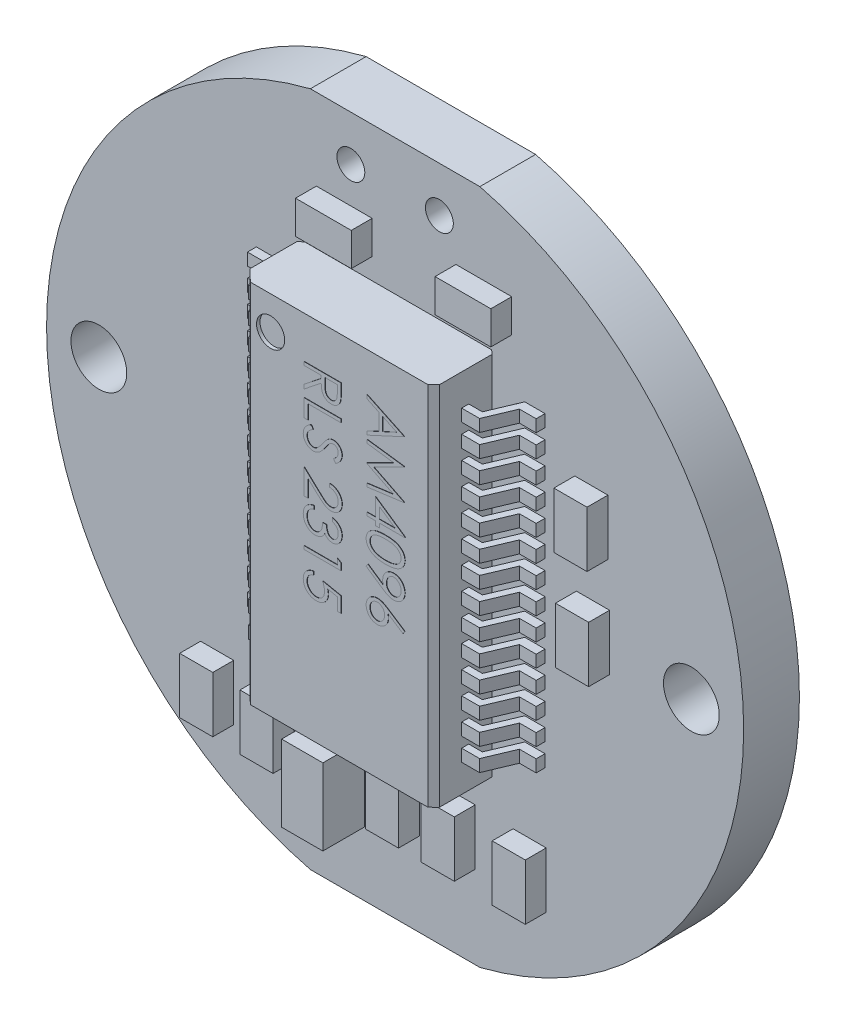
from build123d import *

# Parameters (mm, degrees)
SKETCH1_R           = 0.005
BASE_EXTRUDE_DEPTH  = 1.86
SKETCH5_R           = 0.404245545
CUT_EXTRUDE5_DEPTH  = 0.1
CUT_EXTRUDE9_DEPTH  = 11
BOSS_EXTRUDE1_DEPTH = 0.01
SKETCH7_R           = 0.8
SKETCH7_R_2         = 0.4
EXTRUDE1_DEPTH      = 1.6
SKETCH12_W          = 1.182424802
SKETCH12_H          = 2.190530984
SKETCH12_W_2        = 1.6
SKETCH12_H_2        = 0.95
SKETCH12_W_3        = 0.95
SKETCH12_H_3        = 1.6
EXTRUDE6_DEPTH      = 0.6
SKETCH14_W          = 1.1
SKETCH14_H          = 2.5
SKETCH14_R          = 0.8
BOSS_EXTRUDE2_DEPTH = 0.05
SKETCH18_W          = 1.182424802
SKETCH18_H          = 2.190530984
BOSS_EXTRUDE4_DEPTH = 0.6
BOSS_EXTRUDE5_DEPTH = 1.7
CUT_EXTRUDE10_DEPTH = 8
SKETCH21_W          = 0.9
SKETCH21_H          = 1.6
SKETCH21_W_2        = 1.6
SKETCH21_H_2        = 0.9
SKETCH21_W_3        = 1.559915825
SKETCH21_H_3        = 2.331673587
BOSS_EXTRUDE6_DEPTH = 0.6


with BuildPart() as part:
    # Sketch1 → Base-Extrude (new body)
    with BuildSketch(Plane.XY):
        Polygon((7.968512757, 8.897793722), (9.301851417, 8.897793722), (9.301851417, 8.547793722), (7.968512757, 8.547793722), (7.968512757, 8.247793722), (9.301851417, 8.247793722), (9.301851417, 7.897793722), (7.968512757, 7.897793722), (7.968512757, 7.597793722), (9.301851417, 7.597793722), (9.301851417, 7.247793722), (7.968512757, 7.247793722), (7.968512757, 6.947793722), (9.301851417, 6.947793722), (9.301851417, 6.597793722), (7.968512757, 6.597793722), (7.968512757, 6.297793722), (9.301851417, 6.297793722), (9.301851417, 5.947793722), (7.968512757, 5.947793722), (7.968512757, 5.647793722), (9.301851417, 5.647793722), (9.301851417, 5.297793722), (7.968512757, 5.297793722), (7.968512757, 4.997793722), (9.301851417, 4.997793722), (9.301851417, 4.647793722), (7.968512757, 4.647793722), (7.968512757, 4.347793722), (9.301851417, 4.347793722), (9.301851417, 3.997793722), (7.968512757, 3.997793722), (7.968512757, 3.697793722), (9.301851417, 3.697793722), (9.301851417, 3.347793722), (7.968512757, 3.347793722), (7.968512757, 3.047793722), (9.301851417, 3.047793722), (9.301851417, 2.697793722), (7.968512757, 2.697793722), (7.968512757, 2.397793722), (9.301851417, 2.397793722), (9.301851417, 2.047793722), (7.968512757, 2.047793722), (7.968512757, 1.747793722), (9.301851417, 1.747793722), (9.301851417, 1.397793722), (7.968512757, 1.397793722), (7.968512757, 1.097793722), (9.301851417, 1.097793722), (9.301851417, 0.747793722), (7.968512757, 0.747793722), (7.968512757, 0.447793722), (9.301851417, 0.447793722), (9.301851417, 0.097793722), (7.968512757, 0.097793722), (7.968512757, -0.702206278), (2.368512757, -0.702206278), (2.368512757, 0.097793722), (1.018512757, 0.097793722), (1.018512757, 0.447793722), (2.368512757, 0.447793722), (2.368512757, 0.747793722), (1.018512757, 0.747793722), (1.018512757, 1.097793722), (2.368512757, 1.097793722), (2.368512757, 1.397793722), (1.018512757, 1.397793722), (1.018512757, 1.747793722), (2.368512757, 1.747793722), (2.368512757, 2.047793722), (1.018512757, 2.047793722), (1.018512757, 2.397793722), (2.368512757, 2.397793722), (2.368512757, 2.697793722), (1.018512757, 2.697793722), (1.018512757, 3.047793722), (2.368512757, 3.047793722), (2.368512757, 3.347793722), (1.018512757, 3.347793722), (1.018512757, 3.697793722), (2.368512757, 3.697793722), (2.368512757, 3.997793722), (1.018512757, 3.997793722), (1.018512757, 4.347793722), (2.368512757, 4.347793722), (2.368512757, 4.647793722), (1.018512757, 4.647793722), (1.018512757, 4.997793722), (2.368512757, 4.997793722), (2.368512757, 5.297793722), (1.018512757, 5.297793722), (1.018512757, 5.647793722), (2.368512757, 5.647793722), (2.368512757, 5.947793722), (1.018512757, 5.947793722), (1.018512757, 6.297793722), (2.368512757, 6.297793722), (2.368512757, 6.597793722), (1.018512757, 6.597793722), (1.018512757, 6.947793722), (2.368512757, 6.947793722), (2.368512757, 7.247793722), (1.018512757, 7.247793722), (1.018512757, 7.597793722), (2.368512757, 7.597793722), (2.368512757, 7.897793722), (1.018512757, 7.897793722), (1.018512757, 8.247793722), (2.368512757, 8.247793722), (2.368512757, 8.547793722), (1.018512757, 8.547793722), (1.018512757, 8.897793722), (2.368512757, 8.897793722), (2.368512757, 9.797793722), (7.968512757, 9.797793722), align=None)
        with Locations((5.168512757, 4.547793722)):
            Circle(SKETCH1_R, mode=Mode.SUBTRACT)
    extrude(amount=BASE_EXTRUDE_DEPTH)

    # Sketch5 → Cut-Extrude5 (cut)
    with BuildSketch(Plane.XY.offset(1.86)):
        with Locations((3.288537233, 8.84582504)):
            Circle(SKETCH5_R)
    extrude(amount=-CUT_EXTRUDE5_DEPTH, mode=Mode.SUBTRACT)

    # Sketch15 → Cut-Extrude9 (cut)
    with BuildSketch(Plane(origin=(0, 9.797793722, 0), x_dir=(1, 0, 0), z_dir=(0, 1, 0))):
        Polygon((1.018512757, -0.2554117), (1.515038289, -0.2554117), (1.85430492, -1.060183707), (2.368512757, -1.060183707), (2.368512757, -1.533579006), (2.706416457, -1.86), (2.651187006, -2.385690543), (0.552467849, -2.385690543), (0.552467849, -0.2554117), align=None)
        Polygon((1.617607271, 0), (1.978441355, -0.855932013), (2.368512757, -0.855932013), (2.368512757, -0.187465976), (2.485498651, -0.081833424), (7.851526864, -0.081833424), (7.968512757, -0.187465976), (7.968512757, -0.855932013), (8.35858416, -0.855932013), (8.719418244, 0), align=None)
        Polygon((9.784557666, -2.385690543), (7.747123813, -2.38958058), (7.802761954, -1.86), (7.968512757, -1.696789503), (7.968512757, -1.060183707), (8.482720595, -1.060183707), (8.821987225, -0.2554117), (9.784557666, -0.2554117), align=None)
    extrude(amount=-CUT_EXTRUDE9_DEPTH, mode=Mode.SUBTRACT)

    # Sketch6 → Boss-Extrude1 (add)
    # profile 1 of 13: a face of its own
    with BuildSketch(Plane.XY.offset(1.86)):
        Polygon((7.124163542, 8.168306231), (6.065830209, 7.679844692), (6.065830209, 7.783091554), (6.40503961, 7.939551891), (6.40503961, 8.419321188), (6.065830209, 8.580233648), (6.065830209, 8.683904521), (7.124163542, 8.181874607), align=None)
        Polygon((6.917881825, 8.176150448), (6.513586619, 8.36780376), (6.513586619, 7.989585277), align=None, mode=Mode.SUBTRACT)
    # profile 2 of 13: a face of its own
    with BuildSketch(Plane.XY.offset(1.86)):
        Polygon((6.065830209, 7.571297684), (7.124163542, 7.431585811), (7.124163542, 7.418017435), (6.255787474, 6.981073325), (7.124163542, 6.545189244), (7.124163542, 6.531408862), (6.065830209, 6.390848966), (6.065830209, 6.48625161), (6.827355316, 6.587590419), (6.065830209, 6.969625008), (6.065830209, 6.991037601), (6.829051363, 7.374556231), (6.065830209, 7.475683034), align=None)
    # profile 3 of 13: a face of its own
    with BuildSketch(Plane.XY.offset(1.86)):
        Polygon((7.151300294, 5.691017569), (7.151300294, 5.671725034), (6.418607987, 5.671725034), (6.418607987, 5.54960965), (6.310060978, 5.54960965), (6.310060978, 5.671725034), (6.065830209, 5.671725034), (6.065830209, 5.766703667), (6.310060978, 5.766703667), (6.310060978, 6.268733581), align=None)
        Polygon((6.418607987, 5.766703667), (6.878236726, 5.766703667), (6.418607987, 6.08216841), align=None, mode=Mode.SUBTRACT)
    # profile 4 of 13: a face of its own
    with BuildSketch(Plane.XY.offset(1.86)):
        with BuildLine():
            add(Edge.make_bspline(
                [(6.594572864, 5.454631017), (6.611535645, 5.454531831), (6.644486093, 5.45433916), (6.692499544, 5.452195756), (6.737542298, 5.448635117), (6.77961651, 5.443755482), (6.818733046, 5.437817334), (6.854787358, 5.429890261), (6.887946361, 5.420875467), (6.918318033, 5.410427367), (6.946312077, 5.398638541), (6.97244432, 5.385806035), (6.996681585, 5.37142758), (7.019387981, 5.35630038), (7.040310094, 5.339871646), (7.059408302, 5.322314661), (7.076694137, 5.303455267), (7.09237333, 5.283666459), (7.106031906, 5.262823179), (7.118339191, 5.241567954), (7.128440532, 5.219525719), (7.136740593, 5.196897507), (7.143391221, 5.173749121), (7.147996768, 5.149984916), (7.150883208, 5.12559915), (7.151159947, 5.109140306), (7.151300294, 5.10079321)],
                knots=[0, 0, 0, 0, 1.646377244, 3.198111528, 4.663803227, 6.031090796, 7.308794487, 8.502186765, 9.612154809, 10.642545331, 11.617106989, 12.558866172, 13.465886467, 14.35053239, 15.20542558, 16.045215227, 16.865619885, 17.686225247, 18.492864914, 19.282407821, 20.068097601, 20.842842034, 21.620163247, 22.403093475, 23.190129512, 24, 24, 24, 24], degree=3))
            add(Edge.make_bspline(
                [(7.151300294, 5.10079321), (7.151152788, 5.092376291), (7.150859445, 5.075637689), (7.148040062, 5.050890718), (7.14336189, 5.026715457), (7.136733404, 5.003214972), (7.12850995, 4.980196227), (7.118202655, 4.957839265), (7.106204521, 4.936005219), (7.092106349, 4.915041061), (7.076387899, 4.894716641), (7.058619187, 4.875531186), (7.038979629, 4.857482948), (7.017679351, 4.840345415), (6.994309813, 4.824604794), (6.969277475, 4.809614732), (6.942144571, 4.796197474), (6.913363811, 4.783275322), (6.882138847, 4.7721214), (6.848645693, 4.762062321), (6.812488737, 4.753934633), (6.773857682, 4.747164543), (6.732610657, 4.741919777), (6.688836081, 4.738099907), (6.642505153, 4.736082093), (6.610828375, 4.735702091), (6.594572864, 4.735507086)],
                knots=[0, 0, 0, 0, 0.810914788, 1.612654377, 2.396697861, 3.181598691, 3.963628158, 4.749916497, 5.551656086, 6.361998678, 7.18212741, 8.025565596, 8.878627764, 9.750805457, 10.657531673, 11.591944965, 12.560506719, 13.57287815, 14.630710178, 15.753379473, 16.941251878, 18.199788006, 19.531962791, 20.947069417, 22.433333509, 24, 24, 24, 24], degree=3))
            add(Edge.make_bspline(
                [(6.594572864, 4.735507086), (6.578388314, 4.735704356), (6.546853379, 4.736088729), (6.500730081, 4.73807464), (6.457190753, 4.742004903), (6.416114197, 4.746866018), (6.377744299, 4.75379061), (6.341716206, 4.76166265), (6.308340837, 4.771446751), (6.277280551, 4.782448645), (6.248640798, 4.795090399), (6.221742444, 4.808626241), (6.196730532, 4.823524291), (6.173361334, 4.839358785), (6.151876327, 4.856350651), (6.132222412, 4.874475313), (6.114412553, 4.893746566), (6.098479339, 4.914116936), (6.08454528, 4.93541089), (6.072090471, 4.957172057), (6.061984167, 4.97983477), (6.053451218, 5.002895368), (6.046807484, 5.026571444), (6.042258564, 5.050839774), (6.039059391, 5.07562088), (6.038815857, 5.092373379), (6.038693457, 5.10079321)],
                knots=[0, 0, 0, 0, 1.56130642, 3.042141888, 4.451772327, 5.777565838, 7.030558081, 8.211376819, 9.333164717, 10.383253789, 11.387583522, 12.350962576, 13.286244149, 14.193812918, 15.072134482, 15.925989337, 16.770211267, 17.600669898, 18.417446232, 19.22325363, 20.01647746, 20.807971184, 21.593601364, 22.38506573, 23.188331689, 24, 24, 24, 24], degree=3))
            add(Edge.make_bspline(
                [(6.038693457, 5.10079321), (6.038835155, 5.109139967), (6.039114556, 5.125598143), (6.041981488, 5.149988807), (6.046656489, 5.173715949), (6.053005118, 5.196827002), (6.061073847, 5.219369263), (6.071336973, 5.241121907), (6.083240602, 5.262372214), (6.096783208, 5.283023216), (6.112302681, 5.302681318), (6.129466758, 5.32145915), (6.148705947, 5.338882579), (6.169712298, 5.355105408), (6.19230757, 5.370499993), (6.216714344, 5.384737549), (6.24309143, 5.397545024), (6.27124001, 5.409598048), (6.301834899, 5.420222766), (6.335170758, 5.429536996), (6.371431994, 5.43730171), (6.410510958, 5.443546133), (6.452436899, 5.448694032), (6.497283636, 5.452178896), (6.545012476, 5.454340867), (6.57775127, 5.454532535), (6.594572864, 5.454631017)],
                knots=[0, 0, 0, 0, 0.810940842, 1.599017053, 2.38298203, 3.159479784, 3.926441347, 4.70693857, 5.494146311, 6.292334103, 7.104379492, 7.925868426, 8.762126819, 9.623561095, 10.503686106, 11.41783325, 12.366995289, 13.351843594, 14.392337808, 15.512229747, 16.713911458, 17.994391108, 19.357476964, 20.818259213, 22.365182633, 24, 24, 24, 24], degree=3))
        make_face()
        with BuildLine():
            add(Edge.make_bspline(
                [(6.594996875, 5.359652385), (6.580860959, 5.359616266), (6.553425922, 5.359546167), (6.513559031, 5.357714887), (6.476375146, 5.355220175), (6.441827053, 5.352002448), (6.41003169, 5.34722394), (6.380770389, 5.341869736), (6.354197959, 5.335354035), (6.330132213, 5.327644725), (6.308164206, 5.318864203), (6.287723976, 5.30927574), (6.268563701, 5.298980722), (6.250877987, 5.287438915), (6.234490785, 5.274912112), (6.219449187, 5.261379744), (6.205818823, 5.24686561), (6.189645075, 5.22677329), (6.172733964, 5.200378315), (6.158189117, 5.166951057), (6.148989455, 5.132588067), (6.147822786, 5.109257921), (6.147240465, 5.097613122)],
                knots=[0, 0, 0, 0, 1.459116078, 2.831857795, 4.118796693, 5.306371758, 6.412361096, 7.436813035, 8.376339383, 9.234574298, 10.043323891, 10.816788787, 11.564361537, 12.286735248, 12.994408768, 13.691741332, 14.372975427, 15.047457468, 16.352811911, 17.594285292, 18.799233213, 20, 20, 20, 20], degree=3))
            add(Edge.make_bspline(
                [(6.147240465, 5.097613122), (6.147723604, 5.08589354), (6.148688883, 5.062478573), (6.158001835, 5.028269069), (6.172053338, 4.995058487), (6.188668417, 4.969031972), (6.204491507, 4.949231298), (6.217982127, 4.935044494), (6.23308783, 4.922023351), (6.24938595, 4.909673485), (6.267187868, 4.898346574), (6.28640798, 4.88804653), (6.30709966, 4.878647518), (6.321544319, 4.87329264), (6.328929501, 4.870554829)],
                knots=[0, 0, 0, 0, 1.353760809, 2.704726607, 4.075137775, 5.516104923, 6.260822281, 7.007110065, 7.778089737, 8.566572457, 9.372053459, 10.217411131, 11.088608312, 12, 12, 12, 12], degree=3))
            add(Edge.make_bspline(
                [(6.328929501, 4.870554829), (6.338372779, 4.867364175), (6.357546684, 4.86088578), (6.387289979, 4.852536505), (6.418496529, 4.845961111), (6.450979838, 4.840045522), (6.484979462, 4.836007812), (6.520390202, 4.832757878), (6.557238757, 4.830843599), (6.582274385, 4.830606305), (6.594996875, 4.830485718)],
                knots=[0, 0, 0, 0, 0.884706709, 1.796334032, 2.740027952, 3.714592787, 4.726048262, 5.777819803, 6.87074269, 8, 8, 8, 8], degree=3))
            add(Edge.make_bspline(
                [(6.594996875, 4.830485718), (6.607719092, 4.830618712), (6.632609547, 4.83087891), (6.669024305, 4.832588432), (6.703670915, 4.835335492), (6.736580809, 4.839053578), (6.76769541, 4.844157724), (6.797059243, 4.850287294), (6.824664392, 4.857473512), (6.850582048, 4.865716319), (6.874719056, 4.875005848), (6.897127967, 4.885267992), (6.91792758, 4.89621909), (6.937058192, 4.908115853), (6.954606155, 4.920814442), (6.970219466, 4.93465068), (6.984382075, 4.949075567), (7.000548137, 4.969279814), (7.017031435, 4.995730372), (7.032200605, 5.028643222), (7.040911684, 5.062894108), (7.042139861, 5.086048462), (7.042753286, 5.097613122)],
                knots=[0, 0, 0, 0, 1.313668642, 2.570134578, 3.763346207, 4.902004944, 5.98888779, 7.017888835, 7.998425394, 8.933058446, 9.82474457, 10.667209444, 11.476765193, 12.250262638, 12.991704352, 13.7104269, 14.401925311, 15.076585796, 16.378385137, 17.609787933, 18.806186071, 20, 20, 20, 20], degree=3))
            add(Edge.make_bspline(
                [(7.042753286, 5.097613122), (7.042139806, 5.109318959), (7.04091173, 5.132751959), (7.032223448, 5.167351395), (7.017172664, 5.200498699), (7.000441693, 5.226737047), (6.984668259, 5.246915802), (6.970951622, 5.26116482), (6.95586452, 5.274486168), (6.939546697, 5.287023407), (6.921852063, 5.298554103), (6.902694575, 5.308853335), (6.882252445, 5.318436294), (6.860289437, 5.327235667), (6.83618741, 5.334873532), (6.809749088, 5.341700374), (6.780460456, 5.34705133), (6.748576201, 5.351720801), (6.713985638, 5.355281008), (6.676716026, 5.357708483), (6.636780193, 5.359549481), (6.609203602, 5.359617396), (6.594996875, 5.359652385)],
                knots=[0, 0, 0, 0, 1.207964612, 2.418129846, 3.655795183, 4.951004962, 5.620895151, 6.296795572, 6.989224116, 7.696855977, 8.419187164, 9.166715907, 9.940135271, 10.748837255, 11.607021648, 12.548275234, 13.5654991, 14.678641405, 15.874140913, 17.15372626, 18.533675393, 20, 20, 20, 20], degree=3))
        make_face(mode=Mode.SUBTRACT)
    # profile 5 of 13: a face of its own
    with BuildSketch(Plane.XY.offset(1.86)):
        with BuildLine():
            Line((6.038693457, 4.40986606), (6.09148292, 4.485764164))
            Line((6.09148292, 4.485764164), (6.521642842, 4.191500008))
            add(Edge.make_bspline(
                [(6.521642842, 4.191500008), (6.519346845, 4.210275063), (6.514825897, 4.247244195), (6.513995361, 4.284478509), (6.513586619, 4.302803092)],
                knots=[0, 0, 0, 0, 1.015715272, 2, 2, 2, 2], degree=3))
            add(Edge.make_bspline(
                [(6.513586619, 4.302803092), (6.513872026, 4.313912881), (6.514432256, 4.335720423), (6.518847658, 4.367786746), (6.525725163, 4.398644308), (6.535749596, 4.428175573), (6.548561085, 4.456354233), (6.56416715, 4.483278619), (6.582625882, 4.508913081), (6.603738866, 4.532955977), (6.6269257, 4.554821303), (6.6514654, 4.574301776), (6.677644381, 4.59049157), (6.704928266, 4.603940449), (6.733709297, 4.614139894), (6.763659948, 4.621567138), (6.794990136, 4.62613985), (6.816315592, 4.626683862), (6.82714331, 4.626960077)],
                knots=[0, 0, 0, 0, 1.060702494, 2.082066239, 3.085748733, 4.076089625, 5.054723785, 6.037561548, 7.043420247, 8.066922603, 9.088643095, 10.08373341, 11.053858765, 12.022809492, 12.983497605, 13.964038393, 14.966267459, 16, 16, 16, 16], degree=3))
            add(Edge.make_bspline(
                [(6.82714331, 4.626960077), (6.841950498, 4.626435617), (6.871014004, 4.625406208), (6.9134785, 4.617121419), (6.953630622, 4.60349603), (6.9913648, 4.584497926), (7.026138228, 4.560569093), (7.057467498, 4.531810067), (7.084907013, 4.498395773), (7.10849396, 4.461087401), (7.127463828, 4.420763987), (7.141445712, 4.378530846), (7.149670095, 4.334711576), (7.150754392, 4.305027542), (7.151300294, 4.29008274)],
                knots=[0, 0, 0, 0, 1.022988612, 2.007919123, 2.978103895, 3.94594894, 4.918897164, 5.887013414, 6.875921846, 7.89917871, 8.930658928, 9.948724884, 10.967259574, 12, 12, 12, 12], degree=3))
            add(Edge.make_bspline(
                [(7.151300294, 4.29008274), (7.150748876, 4.275420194), (7.149659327, 4.246448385), (7.141609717, 4.2037883), (7.128187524, 4.16289293), (7.109553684, 4.124084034), (7.086045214, 4.088336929), (7.058263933, 4.056068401), (7.025896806, 4.028142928), (6.989829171, 4.004608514), (6.951073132, 3.985719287), (6.910619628, 3.97209015), (6.868758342, 3.963700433), (6.840396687, 3.962643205), (6.82608328, 3.96210965)],
                knots=[0, 0, 0, 0, 1.026337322, 2.02794581, 3.027878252, 4.032696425, 5.033228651, 6.015458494, 7.004668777, 8.016190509, 9.023163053, 10.0152653, 10.998354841, 12, 12, 12, 12], degree=3))
            add(Edge.make_bspline(
                [(6.82608328, 3.96210965), (6.814971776, 3.962461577), (6.792434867, 3.963175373), (6.758226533, 3.968303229), (6.723274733, 3.97660839), (6.693652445, 3.986242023), (6.669435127, 3.99610689), (6.650000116, 4.004594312), (6.629718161, 4.014473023), (6.608738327, 4.026207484), (6.586508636, 4.038475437), (6.563514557, 4.052424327), (6.539627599, 4.067629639), (6.523527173, 4.078464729), (6.515282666, 4.084013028)],
                knots=[0, 0, 0, 0, 1.179688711, 2.392703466, 3.66501481, 4.991562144, 5.695278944, 6.441221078, 7.243328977, 8.089575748, 8.993388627, 9.939305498, 10.944784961, 12, 12, 12, 12], degree=3))
            Line((6.515282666, 4.084013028), (6.038693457, 4.40986606))
        make_face()
        with BuildLine():
            add(Edge.make_bspline(
                [(6.622133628, 4.285206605), (6.622363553, 4.276790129), (6.62281114, 4.260406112), (6.625535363, 4.236403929), (6.630365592, 4.213748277), (6.637296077, 4.192378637), (6.645658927, 4.172080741), (6.65630636, 4.153176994), (6.669011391, 4.135651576), (6.6832868, 4.119387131), (6.699146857, 4.104944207), (6.715746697, 4.092080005), (6.733159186, 4.081145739), (6.751602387, 4.072508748), (6.770627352, 4.065407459), (6.790540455, 4.060503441), (6.811237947, 4.05778675), (6.825298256, 4.057323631), (6.832443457, 4.057088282)],
                knots=[0, 0, 0, 0, 1.163407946, 2.26475976, 3.333800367, 4.359385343, 5.366239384, 6.363380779, 7.350133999, 8.353570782, 9.349036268, 10.310270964, 11.253520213, 12.184142, 13.120487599, 14.056272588, 15.012232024, 16, 16, 16, 16], degree=3))
            add(Edge.make_bspline(
                [(6.832443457, 4.057088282), (6.839591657, 4.057290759), (6.853678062, 4.057689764), (6.874405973, 4.060891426), (6.894271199, 4.066522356), (6.913377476, 4.074082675), (6.931586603, 4.084023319), (6.949017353, 4.095996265), (6.965885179, 4.109941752), (6.981321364, 4.12630773), (6.995734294, 4.143915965), (7.008228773, 4.162848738), (7.01889419, 4.182636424), (7.02761993, 4.203294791), (7.034442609, 4.22486684), (7.039345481, 4.247353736), (7.042058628, 4.270865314), (7.042518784, 4.286825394), (7.042753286, 4.294958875)],
                knots=[0, 0, 0, 0, 0.972051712, 1.915547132, 2.843788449, 3.775556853, 4.704594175, 5.659091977, 6.648619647, 7.675179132, 8.714041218, 9.74046568, 10.755438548, 11.767722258, 12.786148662, 13.828784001, 14.893517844, 16, 16, 16, 16], degree=3))
            add(Edge.make_bspline(
                [(7.042753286, 4.294958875), (7.042518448, 4.30302164), (7.042057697, 4.318840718), (7.039350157, 4.342142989), (7.034411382, 4.364478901), (7.027616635, 4.385984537), (7.018941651, 4.406599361), (7.008228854, 4.426229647), (6.995667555, 4.444965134), (6.981339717, 4.462568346), (6.965811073, 4.478899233), (6.949091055, 4.493090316), (6.931577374, 4.505035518), (6.913379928, 4.514989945), (6.894270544, 4.522546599), (6.87440615, 4.528178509), (6.853678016, 4.531379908), (6.839591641, 4.531778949), (6.832443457, 4.531981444)],
                knots=[0, 0, 0, 0, 1.099545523, 2.15729926, 3.193054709, 4.213957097, 5.228701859, 6.237665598, 7.258567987, 8.299955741, 9.329010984, 10.327149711, 11.283968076, 12.215264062, 13.149297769, 14.079795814, 15.025585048, 16, 16, 16, 16], degree=3))
            add(Edge.make_bspline(
                [(6.832443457, 4.531981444), (6.825292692, 4.531798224), (6.811190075, 4.53143688), (6.790468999, 4.527951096), (6.77060614, 4.522121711), (6.751408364, 4.514314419), (6.73306235, 4.504032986), (6.715655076, 4.491416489), (6.698989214, 4.476628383), (6.6833237, 4.459866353), (6.668944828, 4.441521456), (6.656386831, 4.421928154), (6.645781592, 4.401423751), (6.637272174, 4.379936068), (6.630434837, 4.357624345), (6.625544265, 4.334288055), (6.62283727, 4.310004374), (6.622370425, 4.293551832), (6.622133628, 4.285206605)],
                knots=[0, 0, 0, 0, 0.952633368, 1.87876736, 2.791047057, 3.707742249, 4.635551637, 5.587206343, 6.568248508, 7.601284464, 8.641511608, 9.671105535, 10.699146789, 11.713763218, 12.747829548, 13.806491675, 14.887386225, 16, 16, 16, 16], degree=3))
        make_face(mode=Mode.SUBTRACT)
    # profile 6 of 13: a face of its own
    with BuildSketch(Plane.XY.offset(1.86)):
        with BuildLine():
            Line((7.151300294, 3.33796435), (7.093846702, 3.264822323))
            Line((7.093846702, 3.264822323), (6.66623085, 3.544458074))
            add(Edge.make_bspline(
                [(6.66623085, 3.544458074), (6.669198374, 3.525840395), (6.674986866, 3.489524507), (6.675941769, 3.452765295), (6.676407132, 3.434851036)],
                knots=[0, 0, 0, 0, 1.025318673, 2, 2, 2, 2], degree=3))
            add(Edge.make_bspline(
                [(6.676407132, 3.434851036), (6.676118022, 3.424094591), (6.675548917, 3.402920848), (6.671169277, 3.371834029), (6.664267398, 3.341962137), (6.654206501, 3.313428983), (6.641354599, 3.286132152), (6.625951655, 3.259914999), (6.607202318, 3.235270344), (6.586257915, 3.211880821), (6.56306016, 3.190645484), (6.538445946, 3.171844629), (6.512440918, 3.156052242), (6.485058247, 3.143239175), (6.456340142, 3.133289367), (6.426323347, 3.12603596), (6.394987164, 3.121748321), (6.373675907, 3.121166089), (6.362850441, 3.120870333)],
                knots=[0, 0, 0, 0, 1.04369286, 2.054478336, 3.041073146, 4.015093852, 4.984733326, 5.965804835, 6.960378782, 7.985147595, 9.009457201, 10.008161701, 10.986880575, 11.956520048, 12.937015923, 13.931873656, 14.949455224, 16, 16, 16, 16], degree=3))
            add(Edge.make_bspline(
                [(6.362850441, 3.120870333), (6.348048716, 3.121422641), (6.318939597, 3.12250881), (6.276365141, 3.130415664), (6.236130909, 3.144061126), (6.198078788, 3.162317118), (6.163315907, 3.186002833), (6.131899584, 3.214071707), (6.104515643, 3.246789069), (6.081024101, 3.283380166), (6.062360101, 3.322983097), (6.048561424, 3.364508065), (6.040316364, 3.407600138), (6.039236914, 3.436865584), (6.038693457, 3.4515995)],
                knots=[0, 0, 0, 0, 1.031881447, 2.029301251, 3.006342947, 3.987068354, 4.962916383, 5.929513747, 6.915671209, 7.928552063, 8.953527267, 9.960179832, 10.973036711, 12, 12, 12, 12], degree=3))
            add(Edge.make_bspline(
                [(6.038693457, 3.4515995), (6.039155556, 3.465840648), (6.040070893, 3.494049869), (6.048224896, 3.535546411), (6.061441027, 3.575419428), (6.079648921, 3.613388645), (6.102646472, 3.648563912), (6.130336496, 3.680023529), (6.162107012, 3.707658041), (6.198055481, 3.730534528), (6.236435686, 3.749178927), (6.276819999, 3.762329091), (6.318395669, 3.770833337), (6.346696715, 3.771710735), (6.360942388, 3.772152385)],
                knots=[0, 0, 0, 0, 1.011913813, 2.004424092, 2.994488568, 3.992479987, 4.990471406, 5.973328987, 6.963763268, 7.974390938, 8.994854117, 9.989689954, 10.988086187, 12, 12, 12, 12], degree=3))
            add(Edge.make_bspline(
                [(6.360942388, 3.772152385), (6.371837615, 3.77176883), (6.394073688, 3.770986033), (6.427848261, 3.766314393), (6.462271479, 3.757746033), (6.49145295, 3.748473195), (6.515620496, 3.739271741), (6.534704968, 3.73073994), (6.554858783, 3.721200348), (6.575700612, 3.710018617), (6.59782595, 3.698165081), (6.620415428, 3.684318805), (6.644294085, 3.669870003), (6.660192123, 3.659285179), (6.668350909, 3.653853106)],
                knots=[0, 0, 0, 0, 1.17367173, 2.395347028, 3.66355231, 4.98980831, 5.690886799, 6.447442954, 7.240630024, 8.091733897, 8.994365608, 9.943299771, 10.944512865, 12, 12, 12, 12], degree=3))
            Line((6.668350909, 3.653853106), (7.151300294, 3.33796435))
        make_face()
        with BuildLine():
            add(Edge.make_bspline(
                [(6.567860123, 3.454779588), (6.567621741, 3.46284149), (6.567154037, 3.478658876), (6.564512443, 3.501835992), (6.559507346, 3.523712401), (6.553033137, 3.544537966), (6.544218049, 3.564095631), (6.533637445, 3.582608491), (6.521057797, 3.599892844), (6.506619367, 3.615645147), (6.491042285, 3.630109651), (6.474257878, 3.642551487), (6.456778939, 3.653295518), (6.438441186, 3.662028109), (6.419256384, 3.668828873), (6.399311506, 3.67374803), (6.378473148, 3.676485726), (6.364342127, 3.67694118), (6.357126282, 3.677173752)],
                knots=[0, 0, 0, 0, 1.129474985, 2.216020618, 3.260639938, 4.268601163, 5.26556745, 6.258792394, 7.250684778, 8.252748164, 9.247500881, 10.223461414, 11.174097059, 12.117127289, 13.062595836, 14.020469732, 14.98917545, 16, 16, 16, 16], degree=3))
            add(Edge.make_bspline(
                [(6.357126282, 3.677173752), (6.349975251, 3.676983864), (6.335953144, 3.676611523), (6.315284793, 3.673246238), (6.295413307, 3.668069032), (6.276324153, 3.660490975), (6.258121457, 3.650985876), (6.240675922, 3.639288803), (6.223975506, 3.625597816), (6.208441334, 3.609682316), (6.194193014, 3.592518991), (6.181506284, 3.574367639), (6.170852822, 3.555285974), (6.162430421, 3.535165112), (6.155532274, 3.514286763), (6.15067463, 3.492491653), (6.147929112, 3.46976063), (6.147473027, 3.454362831), (6.147240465, 3.446511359)],
                knots=[0, 0, 0, 0, 0.989642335, 1.94054129, 2.892446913, 3.828371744, 4.778262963, 5.730973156, 6.732161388, 7.763274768, 8.805796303, 9.818398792, 10.825975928, 11.825728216, 12.834635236, 13.867465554, 14.912602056, 16, 16, 16, 16], degree=3))
            add(Edge.make_bspline(
                [(6.147240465, 3.446511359), (6.147473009, 3.438659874), (6.147929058, 3.42326205), (6.150674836, 3.40053121), (6.155531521, 3.378735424), (6.162433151, 3.357859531), (6.170842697, 3.337729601), (6.18157304, 3.318631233), (6.194115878, 3.300306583), (6.208465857, 3.283154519), (6.223887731, 3.267172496), (6.240827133, 3.253802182), (6.257982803, 3.241735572), (6.276396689, 3.232595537), (6.295401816, 3.224933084), (6.315287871, 3.219782), (6.335952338, 3.21640975), (6.349974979, 3.216038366), (6.357126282, 3.215848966)],
                knots=[0, 0, 0, 0, 1.087205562, 2.132157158, 3.164804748, 4.173533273, 5.173108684, 6.180507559, 7.20098426, 8.243321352, 9.274252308, 10.269075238, 11.227079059, 12.172305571, 13.108064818, 14.05980203, 15.010532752, 16, 16, 16, 16], degree=3))
            add(Edge.make_bspline(
                [(6.357126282, 3.215848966), (6.364352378, 3.216013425), (6.378534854, 3.216336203), (6.399292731, 3.220057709), (6.419418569, 3.225084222), (6.438458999, 3.233207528), (6.456940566, 3.242883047), (6.474335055, 3.255209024), (6.491135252, 3.269341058), (6.506722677, 3.285707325), (6.520980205, 3.303512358), (6.533564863, 3.322446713), (6.544186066, 3.34225492), (6.553047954, 3.362917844), (6.559443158, 3.38467199), (6.56447878, 3.407166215), (6.567158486, 3.430688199), (6.567623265, 3.446646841), (6.567860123, 3.454779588)],
                knots=[0, 0, 0, 0, 0.978265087, 1.920016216, 2.851775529, 3.783928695, 4.718195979, 5.674835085, 6.667117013, 7.690134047, 8.732874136, 9.755756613, 10.767227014, 11.776017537, 12.797239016, 13.836276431, 14.897336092, 16, 16, 16, 16], degree=3))
        make_face(mode=Mode.SUBTRACT)
    # profile 7 of 13: a face of its own
    with BuildSketch(Plane.XY.offset(1.86)):
        with BuildLine():
            Line((5.319569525, 8.602494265), (5.319569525, 8.390700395))
            add(Edge.make_bspline(
                [(5.319569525, 8.390700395), (5.319522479, 8.376566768), (5.319432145, 8.349428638), (5.31892845, 8.310550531), (5.317484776, 8.275224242), (5.316242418, 8.243468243), (5.313976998, 8.215283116), (5.311811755, 8.190582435), (5.308977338, 8.169479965), (5.306344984, 8.156705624), (5.305153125, 8.150921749)],
                knots=[0, 0, 0, 0, 1.410062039, 2.707475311, 3.878576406, 4.937260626, 5.877586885, 6.699081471, 7.410979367, 8, 8, 8, 8], degree=3))
            add(Edge.make_bspline(
                [(5.305153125, 8.150921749), (5.303240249, 8.143178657), (5.299455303, 8.127857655), (5.291451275, 8.105800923), (5.2822041, 8.084773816), (5.271258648, 8.064855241), (5.258805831, 8.046043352), (5.244772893, 8.028366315), (5.229088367, 8.011925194), (5.212152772, 7.996593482), (5.193818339, 7.98269578), (5.174352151, 7.970669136), (5.153875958, 7.960370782), (5.132318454, 7.952149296), (5.109861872, 7.945535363), (5.086310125, 7.940870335), (5.061768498, 7.93807307), (5.045029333, 7.937788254), (5.03654168, 7.937643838)],
                knots=[0, 0, 0, 0, 1.02737288, 2.032829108, 3.019628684, 3.985738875, 4.958353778, 5.924249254, 6.890702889, 7.883913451, 8.865824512, 9.85161466, 10.829249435, 11.81541824, 12.821369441, 13.843154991, 14.906364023, 16, 16, 16, 16], degree=3))
            add(Edge.make_bspline(
                [(5.03654168, 7.937643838), (5.022440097, 7.938088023), (4.994924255, 7.938954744), (4.954991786, 7.947036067), (4.917740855, 7.960272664), (4.883223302, 7.978515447), (4.852093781, 8.001736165), (4.824844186, 8.029642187), (4.801830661, 8.062091), (4.786041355, 8.092440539), (4.775881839, 8.11926245), (4.768697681, 8.141408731), (4.763240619, 8.165584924), (4.758280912, 8.191444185), (4.754496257, 8.219186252), (4.751808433, 8.248755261), (4.750080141, 8.280225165), (4.749827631, 8.30179695), (4.74969773, 8.312894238)],
                knots=[0, 0, 0, 0, 1.260402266, 2.459371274, 3.627181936, 4.786749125, 5.93865593, 7.087644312, 8.261344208, 9.485713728, 10.136162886, 10.825977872, 11.566646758, 12.35154167, 13.181268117, 14.0701832, 15.007234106, 16, 16, 16, 16], degree=3))
            Line((4.74969773, 8.312894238), (4.261236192, 7.924075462))
            Line((4.261236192, 7.924075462), (4.261236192, 8.041526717))
            Line((4.261236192, 8.041526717), (4.74969773, 8.430345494))
            Line((4.74969773, 8.430345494), (4.74969773, 8.507515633))
            Line((4.74969773, 8.507515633), (4.261236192, 8.507515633))
            Line((4.261236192, 8.507515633), (4.261236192, 8.602494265))
            Line((4.261236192, 8.602494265), (5.319569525, 8.602494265))
        make_face()
        with BuildLine():
            Line((5.211022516, 8.507515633), (4.858244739, 8.507515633))
            Line((4.858244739, 8.507515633), (4.856760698, 8.313742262))
            add(Edge.make_bspline(
                [(4.856760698, 8.313742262), (4.856756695, 8.304695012), (4.856748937, 8.287158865), (4.857956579, 8.261788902), (4.859330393, 8.23816687), (4.861431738, 8.216383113), (4.864139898, 8.196427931), (4.86752742, 8.178311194), (4.87147427, 8.162003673), (4.877582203, 8.142983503), (4.887264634, 8.121751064), (4.901327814, 8.098647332), (4.919130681, 8.079039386), (4.939164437, 8.062133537), (4.961644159, 8.049111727), (4.985572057, 8.039634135), (5.010741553, 8.033686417), (5.028029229, 8.032979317), (5.036753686, 8.03262247)],
                knots=[0, 0, 0, 0, 1.14660753, 2.222451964, 3.218720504, 4.145691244, 4.995719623, 5.770487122, 6.480909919, 7.121111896, 8.299844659, 9.430703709, 10.534634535, 11.641396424, 12.741395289, 13.810956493, 14.895269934, 16, 16, 16, 16], degree=3))
            add(Edge.make_bspline(
                [(5.036753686, 8.03262247), (5.045267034, 8.032980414), (5.062137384, 8.033689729), (5.086767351, 8.039645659), (5.110179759, 8.049263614), (5.131928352, 8.062750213), (5.151834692, 8.0790467), (5.168631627, 8.098401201), (5.18269808, 8.119839), (5.191621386, 8.139889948), (5.197103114, 8.157799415), (5.200955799, 8.173351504), (5.204077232, 8.190990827), (5.206504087, 8.210675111), (5.208687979, 8.232368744), (5.210103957, 8.256131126), (5.210959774, 8.281934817), (5.211001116, 8.299819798), (5.211022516, 8.309078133)],
                knots=[0, 0, 0, 0, 1.100801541, 2.181386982, 3.260112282, 4.364594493, 5.481957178, 6.577424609, 7.668452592, 8.790448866, 9.403819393, 10.091598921, 10.863153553, 11.720938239, 12.658472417, 13.685008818, 14.801622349, 16, 16, 16, 16], degree=3))
            Line((5.211022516, 8.309078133), (5.211022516, 8.507515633))
        make_face(mode=Mode.SUBTRACT)
    # profile 8 of 13: a face of its own
    with BuildSketch(Plane.XY.offset(1.86)):
        Polygon((5.319569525, 7.706981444), (5.319569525, 7.612002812), (4.3697832, 7.612002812), (4.3697832, 7.20495153), (4.261236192, 7.20495153), (4.261236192, 7.706981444), align=None)
    # profile 9 of 13: a face of its own
    with BuildSketch(Plane.XY.offset(1.86)):
        with BuildLine():
            Line((4.46539785, 7.13710965), (4.519035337, 7.04764317))
            add(Edge.make_bspline(
                [(4.519035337, 7.04764317), (4.505106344, 7.039322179), (4.478418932, 7.023379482), (4.442357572, 6.996784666), (4.411707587, 6.96922781), (4.386647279, 6.940504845), (4.366917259, 6.910791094), (4.352946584, 6.879892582), (4.344233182, 6.847913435), (4.343174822, 6.826149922), (4.342646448, 6.81528473)],
                knots=[0, 0, 0, 0, 1.272034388, 2.437168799, 3.508375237, 4.49857839, 5.41946034, 6.295179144, 7.148887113, 8, 8, 8, 8], degree=3))
            add(Edge.make_bspline(
                [(4.342646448, 6.81528473), (4.342904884, 6.806005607), (4.343417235, 6.787609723), (4.348340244, 6.760527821), (4.355903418, 6.734226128), (4.366735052, 6.709247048), (4.379839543, 6.685934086), (4.39566888, 6.665493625), (4.413387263, 6.647811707), (4.433168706, 6.633387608), (4.454369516, 6.622190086), (4.476325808, 6.614087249), (4.498941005, 6.608930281), (4.514273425, 6.608273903), (4.522003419, 6.607942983)],
                knots=[0, 0, 0, 0, 1.095270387, 2.171376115, 3.241375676, 4.322296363, 5.380636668, 6.392615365, 7.366724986, 8.328592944, 9.273498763, 10.190095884, 11.087518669, 12, 12, 12, 12], degree=3))
            add(Edge.make_bspline(
                [(4.522003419, 6.607942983), (4.530815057, 6.608388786), (4.548727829, 6.60929504), (4.57515582, 6.616954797), (4.601309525, 6.62900445), (4.617487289, 6.640120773), (4.625886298, 6.645892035)],
                knots=[0, 0, 0, 0, 0.938893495, 1.908633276, 2.914225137, 4, 4, 4, 4], degree=3))
            add(Edge.make_bspline(
                [(4.625886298, 6.645892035), (4.631960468, 6.650617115), (4.644749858, 6.660565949), (4.663468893, 6.677906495), (4.683249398, 6.697725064), (4.704011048, 6.720120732), (4.725374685, 6.745538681), (4.747785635, 6.773456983), (4.771176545, 6.804020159), (4.786644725, 6.825559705), (4.794642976, 6.836697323)],
                knots=[0, 0, 0, 0, 0.72226686, 1.520759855, 2.393439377, 3.351307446, 4.386958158, 5.510256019, 6.712608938, 8, 8, 8, 8], degree=3))
            add(Edge.make_bspline(
                [(4.794642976, 6.836697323), (4.802575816, 6.847830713), (4.817742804, 6.869116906), (4.840223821, 6.898908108), (4.860908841, 6.925512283), (4.879509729, 6.949064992), (4.896837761, 6.968956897), (4.911964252, 6.985915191), (4.925696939, 6.999314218), (4.93459842, 7.006770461), (4.938594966, 7.01011813)],
                knots=[0, 0, 0, 0, 1.452255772, 2.776602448, 3.96446981, 5.032613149, 5.964194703, 6.766668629, 7.446264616, 8, 8, 8, 8], degree=3))
            add(Edge.make_bspline(
                [(4.938594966, 7.01011813), (4.944824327, 7.014796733), (4.957075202, 7.023997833), (4.976223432, 7.036143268), (4.995824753, 7.046466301), (5.015931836, 7.05455872), (5.036262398, 7.061373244), (5.057081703, 7.065956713), (5.078296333, 7.068826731), (5.092572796, 7.069120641), (5.099719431, 7.069267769)],
                knots=[0, 0, 0, 0, 1.068054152, 2.10047183, 3.106115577, 4.101338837, 5.06977816, 6.043150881, 7.020423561, 8, 8, 8, 8], degree=3))
            add(Edge.make_bspline(
                [(5.099719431, 7.069267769), (5.110917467, 7.068874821), (5.133074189, 7.068097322), (5.165424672, 7.061468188), (5.196405, 7.051127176), (5.22533277, 7.036171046), (5.252140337, 7.017679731), (5.276418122, 6.995825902), (5.297001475, 6.96987929), (5.314776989, 6.941252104), (5.328811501, 6.910119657), (5.339454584, 6.877555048), (5.345404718, 6.843415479), (5.346268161, 6.820253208), (5.346706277, 6.808500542)],
                knots=[0, 0, 0, 0, 1.005541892, 1.989591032, 2.955705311, 3.932863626, 4.905387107, 5.876519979, 6.856563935, 7.871847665, 8.897921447, 9.918317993, 10.943742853, 12, 12, 12, 12], degree=3))
            add(Edge.make_bspline(
                [(5.346706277, 6.808500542), (5.346284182, 6.796027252), (5.345447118, 6.771291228), (5.337908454, 6.734837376), (5.325731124, 6.699672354), (5.311705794, 6.671366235), (5.297760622, 6.649250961), (5.285053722, 6.632386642), (5.270426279, 6.615296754), (5.253837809, 6.59784394), (5.235136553, 6.58032378), (5.214450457, 6.562476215), (5.191905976, 6.544259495), (5.175811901, 6.532540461), (5.167561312, 6.526532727)],
                knots=[0, 0, 0, 0, 1.286821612, 2.551921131, 3.825787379, 5.12137259, 5.803616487, 6.523126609, 7.299589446, 8.125436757, 9.008162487, 9.944516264, 10.946261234, 12, 12, 12, 12], degree=3))
            Line((5.167561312, 6.526532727), (5.102475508, 6.612395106))
            add(Edge.make_bspline(
                [(5.102475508, 6.612395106), (5.109154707, 6.61757971), (5.122017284, 6.627564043), (5.140030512, 6.642722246), (5.156485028, 6.657009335), (5.170777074, 6.671085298), (5.183689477, 6.684206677), (5.194744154, 6.696942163), (5.204051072, 6.709107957), (5.213978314, 6.724445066), (5.223881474, 6.743762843), (5.23208298, 6.767988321), (5.237188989, 6.793235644), (5.237832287, 6.81038433), (5.238159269, 6.819100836)],
                knots=[0, 0, 0, 0, 1.181667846, 2.275615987, 3.290305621, 4.226321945, 5.078535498, 5.862783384, 6.581873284, 7.217493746, 8.414623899, 9.604724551, 10.782505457, 12, 12, 12, 12], degree=3))
            add(Edge.make_bspline(
                [(5.238159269, 6.819100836), (5.237792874, 6.830033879), (5.237086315, 6.851117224), (5.229369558, 6.881049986), (5.217219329, 6.907990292), (5.200190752, 6.931138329), (5.180015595, 6.950411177), (5.156799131, 6.96435259), (5.131162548, 6.972743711), (5.113279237, 6.973767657), (5.104171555, 6.974289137)],
                knots=[0, 0, 0, 0, 1.14458467, 2.207223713, 3.21896685, 4.227309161, 5.202851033, 6.127160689, 7.046193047, 8, 8, 8, 8], degree=3))
            add(Edge.make_bspline(
                [(5.104171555, 6.974289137), (5.098502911, 6.974164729), (5.087156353, 6.973915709), (5.070348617, 6.970676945), (5.053690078, 6.966084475), (5.037106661, 6.959363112), (5.02020823, 6.950309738), (5.003040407, 6.937999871), (4.985169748, 6.922599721), (4.973558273, 6.910779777), (4.967427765, 6.904539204)],
                knots=[0, 0, 0, 0, 0.858526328, 1.718456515, 2.587092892, 3.476767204, 4.426280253, 5.487868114, 6.673670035, 8, 8, 8, 8], degree=3))
            add(Edge.make_bspline(
                [(4.967427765, 6.904539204), (4.965360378, 6.90222255), (4.960448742, 6.896718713), (4.952407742, 6.886656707), (4.942488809, 6.873369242), (4.930215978, 6.85720329), (4.91597944, 6.837860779), (4.899961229, 6.81533958), (4.88164134, 6.789890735), (4.868833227, 6.771831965), (4.862060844, 6.762283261)],
                knots=[0, 0, 0, 0, 0.420754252, 0.999615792, 1.744751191, 2.668019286, 3.750313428, 4.999500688, 6.413464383, 8, 8, 8, 8], degree=3))
            add(Edge.make_bspline(
                [(4.862060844, 6.762283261), (4.853702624, 6.750797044), (4.837518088, 6.728555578), (4.813201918, 6.696909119), (4.789420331, 6.668215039), (4.766325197, 6.642372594), (4.744091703, 6.619126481), (4.72245236, 6.598734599), (4.701562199, 6.580989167), (4.674779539, 6.561884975), (4.641886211, 6.54236392), (4.60158541, 6.525599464), (4.561127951, 6.515028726), (4.533935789, 6.513646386), (4.520519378, 6.51296435)],
                knots=[0, 0, 0, 0, 1.163667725, 2.253281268, 3.268753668, 4.215851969, 5.092017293, 5.902905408, 6.650798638, 7.335211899, 8.59617414, 9.77448103, 10.901945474, 12, 12, 12, 12], degree=3))
            add(Edge.make_bspline(
                [(4.520519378, 6.51296435), (4.511031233, 6.513163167), (4.492239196, 6.513556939), (4.464644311, 6.518079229), (4.43784807, 6.524713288), (4.412157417, 6.534680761), (4.38722859, 6.546941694), (4.363291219, 6.562085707), (4.340674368, 6.580341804), (4.318907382, 6.600632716), (4.299245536, 6.623182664), (4.281660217, 6.646959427), (4.266941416, 6.672117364), (4.255092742, 6.69853471), (4.24567891, 6.726065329), (4.238912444, 6.754738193), (4.23475006, 6.784633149), (4.234318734, 6.804953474), (4.234099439, 6.81528473)],
                knots=[0, 0, 0, 0, 0.983610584, 1.948120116, 2.894308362, 3.843560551, 4.801159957, 5.773581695, 6.77566113, 7.813174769, 8.857584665, 9.875476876, 10.877851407, 11.875574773, 12.875048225, 13.892438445, 14.928473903, 16, 16, 16, 16], degree=3))
            add(Edge.make_bspline(
                [(4.234099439, 6.81528473), (4.234255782, 6.823277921), (4.234566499, 6.839163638), (4.237248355, 6.862597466), (4.24118133, 6.885600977), (4.247177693, 6.907885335), (4.254624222, 6.929728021), (4.263741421, 6.950934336), (4.274594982, 6.971555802), (4.287202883, 6.991616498), (4.301733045, 7.011305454), (4.318524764, 7.030521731), (4.337462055, 7.049485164), (4.358739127, 7.067848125), (4.382128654, 7.08594909), (4.407826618, 7.10345144), (4.435699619, 7.120711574), (4.45531354, 7.131541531), (4.46539785, 7.13710965)],
                knots=[0, 0, 0, 0, 0.915384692, 1.819241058, 2.699029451, 3.586605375, 4.459625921, 5.340865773, 6.228072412, 7.126546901, 8.052715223, 9.028303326, 10.047266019, 11.120332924, 12.245748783, 13.433636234, 14.680528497, 16, 16, 16, 16], degree=3))
        make_face()
    # profile 10 of 13: a face of its own
    with BuildSketch(Plane.XY.offset(1.86)):
        with BuildLine():
            Line((4.993928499, 5.848113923), (4.993928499, 5.943092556))
            add(Edge.make_bspline(
                [(4.993928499, 5.943092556), (5.006529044, 5.942473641), (5.031276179, 5.941258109), (5.067356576, 5.935563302), (5.101847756, 5.92742229), (5.134454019, 5.915884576), (5.165564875, 5.901636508), (5.194767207, 5.88419275), (5.222350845, 5.863925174), (5.24779354, 5.840870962), (5.271051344, 5.815855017), (5.291348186, 5.789027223), (5.308300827, 5.760663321), (5.322549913, 5.731009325), (5.333232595, 5.699722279), (5.341162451, 5.667101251), (5.345932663, 5.632998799), (5.346445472, 5.609763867), (5.346706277, 5.597946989)],
                knots=[0, 0, 0, 0, 1.100776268, 2.161895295, 3.184016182, 4.190939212, 5.176500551, 6.166955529, 7.155448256, 8.160289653, 9.16017456, 10.133824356, 11.091467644, 12.04088621, 13.000931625, 13.972173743, 14.968683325, 16, 16, 16, 16], degree=3))
            add(Edge.make_bspline(
                [(5.346706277, 5.597946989), (5.346434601, 5.586342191), (5.345900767, 5.563539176), (5.341316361, 5.530258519), (5.334136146, 5.498575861), (5.324062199, 5.468553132), (5.310520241, 5.440429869), (5.29425289, 5.413994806), (5.275438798, 5.388933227), (5.25328824, 5.366373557), (5.229641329, 5.345658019), (5.204396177, 5.327786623), (5.178322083, 5.312482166), (5.151220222, 5.299725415), (5.122835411, 5.29033463), (5.0935809, 5.283205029), (5.063153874, 5.279175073), (5.042559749, 5.278556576), (5.032089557, 5.278242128)],
                knots=[0, 0, 0, 0, 1.111607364, 2.184268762, 3.212621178, 4.221274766, 5.211760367, 6.196651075, 7.1921475, 8.207485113, 9.220403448, 10.201281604, 11.166441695, 12.114753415, 13.065576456, 14.026450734, 14.996634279, 16, 16, 16, 16], degree=3))
            add(Edge.make_bspline(
                [(5.032089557, 5.278242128), (5.01734914, 5.278754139), (4.988126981, 5.279769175), (4.945184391, 5.288451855), (4.903578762, 5.302012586), (4.870093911, 5.318340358), (4.843111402, 5.334811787), (4.820895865, 5.349654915), (4.796975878, 5.367031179), (4.771431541, 5.387193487), (4.744062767, 5.40972476), (4.714886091, 5.434829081), (4.68420296, 5.462685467), (4.663246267, 5.482236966), (4.652387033, 5.492368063)],
                knots=[0, 0, 0, 0, 1.184426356, 2.348067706, 3.509069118, 4.696110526, 5.333549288, 6.050745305, 6.844228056, 7.710549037, 8.667450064, 9.695053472, 10.805634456, 12, 12, 12, 12], degree=3))
            Line((4.652387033, 5.492368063), (4.3697832, 5.757163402))
            Line((4.3697832, 5.757163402), (4.3697832, 5.264673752))
            Line((4.3697832, 5.264673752), (4.261236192, 5.264673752))
            Line((4.261236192, 5.264673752), (4.261236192, 5.983797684))
            Line((4.261236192, 5.983797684), (4.699240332, 5.573354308))
            add(Edge.make_bspline(
                [(4.699240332, 5.573354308), (4.709671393, 5.563360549), (4.729707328, 5.544164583), (4.758968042, 5.51702535), (4.786081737, 5.492610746), (4.811168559, 5.470904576), (4.83408629, 5.45188898), (4.855014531, 5.435624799), (4.873773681, 5.422040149), (4.895811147, 5.40764325), (4.922749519, 5.393914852), (4.955504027, 5.381848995), (4.989296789, 5.374544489), (5.012126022, 5.37366377), (5.023609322, 5.373220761)],
                knots=[0, 0, 0, 0, 1.329530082, 2.553755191, 3.672934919, 4.687409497, 5.60679272, 6.413407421, 7.126401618, 7.737995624, 8.834647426, 9.90044882, 10.943907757, 12, 12, 12, 12], degree=3))
            add(Edge.make_bspline(
                [(5.023609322, 5.373220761), (5.0308314, 5.373411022), (5.045064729, 5.373785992), (5.065919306, 5.377157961), (5.086113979, 5.382112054), (5.105399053, 5.389747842), (5.12415383, 5.398921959), (5.141808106, 5.410642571), (5.158963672, 5.424036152), (5.175032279, 5.439572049), (5.189753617, 5.456627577), (5.20279324, 5.474648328), (5.213690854, 5.493713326), (5.222624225, 5.513743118), (5.229632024, 5.534681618), (5.234487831, 5.556569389), (5.237536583, 5.579345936), (5.237949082, 5.594898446), (5.238159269, 5.602823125)],
                knots=[0, 0, 0, 0, 0.991504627, 1.954065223, 2.895985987, 3.842598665, 4.797835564, 5.759220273, 6.74786863, 7.784730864, 8.824135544, 9.839918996, 10.835834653, 11.835434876, 12.84861661, 13.863796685, 14.911511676, 16, 16, 16, 16], degree=3))
            add(Edge.make_bspline(
                [(5.238159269, 5.602823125), (5.237943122, 5.61109958), (5.237518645, 5.627353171), (5.234547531, 5.651216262), (5.229426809, 5.673983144), (5.222406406, 5.695699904), (5.213567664, 5.716387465), (5.202346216, 5.735858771), (5.189180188, 5.754291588), (5.174171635, 5.771652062), (5.157382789, 5.787603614), (5.138898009, 5.801913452), (5.118597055, 5.814118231), (5.096938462, 5.824937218), (5.073346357, 5.833215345), (5.04839243, 5.840291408), (5.021722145, 5.845431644), (5.003346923, 5.84720498), (4.993928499, 5.848113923)],
                knots=[0, 0, 0, 0, 1.031212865, 2.025131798, 2.990757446, 3.934781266, 4.865570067, 5.788494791, 6.729227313, 7.684356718, 8.643577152, 9.610526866, 10.590658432, 11.59095419, 12.621640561, 13.700587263, 14.82141059, 16, 16, 16, 16], degree=3))
        make_face()
    # profile 11 of 13: a face of its own
    with BuildSketch(Plane.XY.offset(1.86)):
        with BuildLine():
            Line((5.075338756, 5.034011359), (5.075338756, 5.128989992))
            add(Edge.make_bspline(
                [(5.075338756, 5.128989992), (5.085992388, 5.126416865), (5.106819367, 5.121386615), (5.136575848, 5.110894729), (5.164734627, 5.099464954), (5.19076844, 5.085740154), (5.215200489, 5.07076965), (5.237476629, 5.053617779), (5.258163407, 5.035075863), (5.276521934, 5.01456689), (5.293146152, 4.993058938), (5.307320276, 4.970248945), (5.319513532, 4.946595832), (5.329558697, 4.921935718), (5.337125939, 4.896195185), (5.342616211, 4.869606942), (5.346181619, 4.842101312), (5.346529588, 4.823430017), (5.346706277, 4.81394926)],
                knots=[0, 0, 0, 0, 1.162005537, 2.271625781, 3.343758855, 4.383309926, 5.390229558, 6.379919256, 7.361854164, 8.333198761, 9.295911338, 10.242430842, 11.177959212, 12.116337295, 13.062827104, 14.020064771, 14.994644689, 16, 16, 16, 16], degree=3))
            add(Edge.make_bspline(
                [(5.346706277, 4.81394926), (5.346289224, 4.800135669), (5.345464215, 4.772809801), (5.337930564, 4.732664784), (5.326009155, 4.693951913), (5.309537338, 4.657094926), (5.289221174, 4.622859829), (5.265041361, 4.592399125), (5.237464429, 4.566125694), (5.20700482, 4.544083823), (5.174451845, 4.52682543), (5.140947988, 4.514099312), (5.106572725, 4.506351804), (5.083362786, 4.505347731), (5.071734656, 4.504844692)],
                knots=[0, 0, 0, 0, 1.083050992, 2.142477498, 3.193116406, 4.255571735, 5.30263384, 6.308962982, 7.297363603, 8.282367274, 9.249857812, 10.179914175, 11.08814088, 12, 12, 12, 12], degree=3))
            add(Edge.make_bspline(
                [(5.071734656, 4.504844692), (5.060544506, 4.50519654), (5.038647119, 4.505885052), (5.006678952, 4.511731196), (4.97654923, 4.521569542), (4.948131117, 4.53519778), (4.921604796, 4.552839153), (4.896910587, 4.574209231), (4.87393896, 4.599458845), (4.8607795, 4.618593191), (4.854004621, 4.628444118)],
                knots=[0, 0, 0, 0, 1.024540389, 2.004866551, 2.965041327, 3.920577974, 4.882998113, 5.874504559, 6.905732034, 8, 8, 8, 8], degree=3))
            add(Edge.make_bspline(
                [(4.854004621, 4.628444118), (4.848568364, 4.617185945), (4.837797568, 4.594880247), (4.816674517, 4.564475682), (4.792285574, 4.536874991), (4.773252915, 4.521482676), (4.763690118, 4.513748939)],
                knots=[0, 0, 0, 0, 1.015518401, 2.012035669, 3.001164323, 4, 4, 4, 4], degree=3))
            add(Edge.make_bspline(
                [(4.763690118, 4.513748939), (4.756718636, 4.508654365), (4.742889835, 4.498548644), (4.720642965, 4.486110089), (4.698223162, 4.474696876), (4.674748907, 4.466297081), (4.650974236, 4.459048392), (4.626390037, 4.454278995), (4.601229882, 4.451217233), (4.584200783, 4.450787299), (4.575640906, 4.450571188)],
                knots=[0, 0, 0, 0, 1.02516404, 2.033540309, 3.025129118, 4.011046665, 4.991655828, 5.976607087, 6.982917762, 8, 8, 8, 8], degree=3))
            add(Edge.make_bspline(
                [(4.575640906, 4.450571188), (4.560821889, 4.45111501), (4.531253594, 4.452200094), (4.48755835, 4.461859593), (4.444919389, 4.476920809), (4.403968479, 4.497935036), (4.365733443, 4.523935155), (4.331678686, 4.555038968), (4.302208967, 4.590490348), (4.277665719, 4.630057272), (4.258032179, 4.672906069), (4.244408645, 4.718740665), (4.235534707, 4.766894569), (4.234583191, 4.799916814), (4.234099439, 4.816705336)],
                knots=[0, 0, 0, 0, 0.95570045, 1.906903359, 2.87519758, 3.868912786, 4.869932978, 5.851730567, 6.836639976, 7.83677598, 8.849487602, 9.869908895, 10.917060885, 12, 12, 12, 12], degree=3))
            add(Edge.make_bspline(
                [(4.234099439, 4.816705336), (4.234361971, 4.82802022), (4.234878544, 4.850284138), (4.238409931, 4.88301491), (4.244859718, 4.914257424), (4.253539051, 4.944053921), (4.264543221, 4.972430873), (4.278246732, 4.999301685), (4.294367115, 5.024831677), (4.313094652, 5.048779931), (4.334044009, 5.071143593), (4.357587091, 5.091328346), (4.383288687, 5.109670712), (4.411447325, 5.125679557), (4.441699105, 5.140084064), (4.474431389, 5.151931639), (4.509351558, 5.162359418), (4.533686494, 5.167207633), (4.546172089, 5.16969512)],
                knots=[0, 0, 0, 0, 1.048658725, 2.063410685, 3.046034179, 4.001477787, 4.936774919, 5.862367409, 6.792675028, 7.730719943, 8.675894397, 9.627829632, 10.600096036, 11.597688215, 12.626045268, 13.701542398, 14.82072376, 16, 16, 16, 16], degree=3))
            Line((4.546172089, 5.16969512), (4.546172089, 5.074716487))
            add(Edge.make_bspline(
                [(4.546172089, 5.074716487), (4.538023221, 5.072242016), (4.522172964, 5.067428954), (4.499361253, 5.059236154), (4.478449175, 5.049902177), (4.459283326, 5.039888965), (4.441674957, 5.029372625), (4.426089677, 5.017605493), (4.411842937, 5.005459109), (4.403816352, 4.996303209), (4.399888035, 4.99182219)],
                knots=[0, 0, 0, 0, 1.198163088, 2.33053128, 3.407730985, 4.417276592, 5.372219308, 6.28897303, 7.162600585, 8, 8, 8, 8], degree=3))
            add(Edge.make_bspline(
                [(4.399888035, 4.99182219), (4.395319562, 4.985896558), (4.386196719, 4.974063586), (4.37455456, 4.954781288), (4.364466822, 4.934502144), (4.356761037, 4.912786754), (4.350236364, 4.890103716), (4.345966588, 4.866086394), (4.343037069, 4.840946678), (4.342778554, 4.823781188), (4.342646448, 4.815009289)],
                knots=[0, 0, 0, 0, 0.946170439, 1.889420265, 2.845303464, 3.807233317, 4.801018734, 5.828864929, 6.890507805, 8, 8, 8, 8], degree=3))
            add(Edge.make_bspline(
                [(4.342646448, 4.815009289), (4.342832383, 4.80510512), (4.343195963, 4.785738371), (4.346549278, 4.757481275), (4.351411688, 4.730590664), (4.359017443, 4.705340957), (4.368141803, 4.681388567), (4.380087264, 4.659268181), (4.393577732, 4.638329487), (4.40926974, 4.619185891), (4.426231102, 4.601927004), (4.444225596, 4.587013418), (4.462695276, 4.574096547), (4.482071, 4.563713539), (4.50216271, 4.555500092), (4.523045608, 4.549912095), (4.544543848, 4.546025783), (4.559157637, 4.545709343), (4.566524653, 4.545549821)],
                knots=[0, 0, 0, 0, 1.216990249, 2.379719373, 3.493992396, 4.571561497, 5.616923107, 6.638958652, 7.655775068, 8.674704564, 9.676001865, 10.625896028, 11.54399481, 12.441854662, 13.322657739, 14.20572845, 15.095482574, 16, 16, 16, 16], degree=3))
            add(Edge.make_bspline(
                [(4.566524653, 4.545549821), (4.576385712, 4.546012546), (4.596058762, 4.546935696), (4.625001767, 4.553983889), (4.652889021, 4.565576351), (4.679240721, 4.581807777), (4.703675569, 4.601556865), (4.725392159, 4.624632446), (4.743491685, 4.651091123), (4.755950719, 4.675599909), (4.764254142, 4.69736136), (4.770076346, 4.715947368), (4.774730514, 4.736773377), (4.779232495, 4.759589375), (4.78300667, 4.784491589), (4.78616769, 4.811502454), (4.788693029, 4.840632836), (4.789821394, 4.860798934), (4.790402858, 4.871190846)],
                knots=[0, 0, 0, 0, 1.070481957, 2.135637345, 3.216366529, 4.339485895, 5.485746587, 6.620975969, 7.768829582, 8.956804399, 9.598399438, 10.297751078, 11.070570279, 11.915248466, 12.824061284, 13.805856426, 14.869322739, 16, 16, 16, 16], degree=3))
            Line((4.790402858, 4.871190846), (4.898949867, 4.871190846))
            add(Edge.make_bspline(
                [(4.898949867, 4.871190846), (4.899173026, 4.85809776), (4.899610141, 4.832451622), (4.904860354, 4.794983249), (4.912204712, 4.759111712), (4.923194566, 4.725655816), (4.936385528, 4.695261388), (4.951259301, 4.668747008), (4.968110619, 4.646741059), (4.986718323, 4.629188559), (5.006908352, 4.616305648), (5.027731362, 4.606635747), (5.049671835, 4.600966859), (5.064636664, 4.600205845), (5.072158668, 4.599823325)],
                knots=[0, 0, 0, 0, 1.321708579, 2.588902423, 3.815526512, 5.016621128, 6.138757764, 7.158873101, 8.079948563, 8.928590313, 9.728601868, 10.489025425, 11.240515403, 12, 12, 12, 12], degree=3))
            add(Edge.make_bspline(
                [(5.072158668, 4.599823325), (5.077685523, 4.59994862), (5.088680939, 4.600197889), (5.104744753, 4.603342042), (5.120318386, 4.608065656), (5.135331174, 4.614563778), (5.149695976, 4.623245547), (5.163430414, 4.633666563), (5.176764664, 4.645831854), (5.189060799, 4.660059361), (5.200659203, 4.675462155), (5.210685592, 4.692185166), (5.219183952, 4.709859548), (5.226205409, 4.728501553), (5.231483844, 4.748185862), (5.235274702, 4.768816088), (5.237644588, 4.790432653), (5.237985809, 4.805180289), (5.238159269, 4.812677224)],
                knots=[0, 0, 0, 0, 0.884317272, 1.759307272, 2.611736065, 3.488921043, 4.37244062, 5.294096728, 6.247679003, 7.258495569, 8.302441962, 9.333537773, 10.376747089, 11.440883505, 12.520330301, 13.637364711, 14.798958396, 16, 16, 16, 16], degree=3))
            add(Edge.make_bspline(
                [(5.238159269, 4.812677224), (5.237739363, 4.824728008), (5.236919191, 4.848265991), (5.229710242, 4.882192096), (5.218288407, 4.913698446), (5.204496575, 4.937699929), (5.190929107, 4.955453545), (5.179257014, 4.968383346), (5.166023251, 4.980848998), (5.150864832, 4.992361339), (5.134302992, 5.003610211), (5.116246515, 5.014488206), (5.096437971, 5.024645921), (5.082508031, 5.030829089), (5.075338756, 5.034011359)],
                knots=[0, 0, 0, 0, 1.4727372, 2.876598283, 4.222346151, 5.558423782, 6.24313385, 6.953189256, 7.68715613, 8.463578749, 9.278833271, 10.135787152, 11.040551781, 12, 12, 12, 12], degree=3))
        make_face()
    # profile 12 of 13: a face of its own
    with BuildSketch(Plane.XY.offset(1.86)):
        Polygon((5.319569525, 4.130654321), (5.319569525, 3.934972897), (4.261236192, 3.934972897), (4.261236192, 4.02995153), (5.211022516, 4.02995153), (5.211022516, 4.192772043), align=None)
    # profile 13 of 13: a face of its own
    with BuildSketch(Plane.XY.offset(1.86)):
        with BuildLine():
            Line((5.319569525, 2.876639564), (5.211022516, 2.876639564))
            Line((5.211022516, 2.876639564), (5.211022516, 3.236625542))
            Line((5.211022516, 3.236625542), (4.932658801, 3.293655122))
            add(Edge.make_bspline(
                [(4.932658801, 3.293655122), (4.93575224, 3.282450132), (4.94174529, 3.260742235), (4.948399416, 3.228701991), (4.952410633, 3.198284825), (4.952958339, 3.178546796), (4.953223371, 3.168995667)],
                knots=[0, 0, 0, 0, 1.100273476, 2.13160584, 3.095893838, 4, 4, 4, 4], degree=3))
            add(Edge.make_bspline(
                [(4.953223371, 3.168995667), (4.952967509, 3.15717753), (4.952464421, 3.133940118), (4.947635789, 3.099940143), (4.940030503, 3.067486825), (4.929423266, 3.036635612), (4.915771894, 3.007320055), (4.898940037, 2.979703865), (4.879044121, 2.95363053), (4.856276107, 2.92944473), (4.831187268, 2.907537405), (4.80429987, 2.88819974), (4.775589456, 2.872117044), (4.745182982, 2.858885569), (4.713131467, 2.84838767), (4.679197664, 2.841381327), (4.643682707, 2.836721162), (4.619400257, 2.836200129), (4.607017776, 2.835934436)],
                knots=[0, 0, 0, 0, 1.052772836, 2.070014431, 3.053871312, 4.019926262, 4.972333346, 5.930471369, 6.896690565, 7.89035727, 8.885779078, 9.861050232, 10.836829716, 11.812751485, 12.812646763, 13.836748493, 14.896881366, 16, 16, 16, 16], degree=3))
            add(Edge.make_bspline(
                [(4.607017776, 2.835934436), (4.598393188, 2.836135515), (4.581260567, 2.836534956), (4.555817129, 2.838566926), (4.53091156, 2.842476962), (4.506544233, 2.847734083), (4.482747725, 2.854530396), (4.459530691, 2.862847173), (4.436821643, 2.872650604), (4.414619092, 2.883718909), (4.393607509, 2.896522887), (4.373462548, 2.910010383), (4.354925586, 2.924950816), (4.337319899, 2.940620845), (4.321336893, 2.95764705), (4.306292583, 2.975500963), (4.292840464, 2.994601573), (4.280467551, 3.014606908), (4.269389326, 3.035504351), (4.260148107, 3.057505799), (4.252048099, 3.080128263), (4.24546113, 3.103573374), (4.240350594, 3.127795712), (4.236870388, 3.152878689), (4.234338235, 3.178696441), (4.234179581, 3.196196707), (4.234099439, 3.205036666)],
                knots=[0, 0, 0, 0, 1.05623316, 2.098192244, 3.122504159, 4.140841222, 5.148757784, 6.150489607, 7.158294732, 8.176043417, 9.185147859, 10.169157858, 11.142149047, 12.097904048, 13.0527185, 13.998867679, 14.954465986, 15.910220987, 16.877849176, 17.847023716, 18.829548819, 19.818454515, 20.826519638, 21.858115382, 22.918063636, 24, 24, 24, 24], degree=3))
            add(Edge.make_bspline(
                [(4.234099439, 3.205036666), (4.234308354, 3.215581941), (4.234719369, 3.236328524), (4.239018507, 3.266724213), (4.24517712, 3.295968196), (4.254437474, 3.323829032), (4.266057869, 3.350541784), (4.280651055, 3.375750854), (4.297419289, 3.399951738), (4.316941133, 3.422486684), (4.338478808, 3.443359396), (4.361600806, 3.462330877), (4.386399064, 3.478968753), (4.412662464, 3.49334092), (4.440436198, 3.505582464), (4.469803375, 3.515203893), (4.500616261, 3.522968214), (4.521829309, 3.526253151), (4.532603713, 3.527921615)],
                knots=[0, 0, 0, 0, 1.046825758, 2.059506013, 3.044032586, 4.011925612, 4.970610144, 5.93275819, 6.900651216, 7.891265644, 8.889116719, 9.876966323, 10.858259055, 11.851035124, 12.847502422, 13.86866322, 14.9174643, 16, 16, 16, 16], degree=3))
            Line((4.532603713, 3.527921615), (4.532603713, 3.432942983))
            add(Edge.make_bspline(
                [(4.532603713, 3.432942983), (4.522510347, 3.430607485), (4.503110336, 3.426118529), (4.475869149, 3.416239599), (4.451502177, 3.404235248), (4.429986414, 3.389636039), (4.411125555, 3.372573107), (4.394172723, 3.35324227), (4.37908112, 3.331368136), (4.366420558, 3.307070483), (4.355638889, 3.281421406), (4.348455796, 3.254580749), (4.343406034, 3.227274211), (4.342900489, 3.208805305), (4.342646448, 3.199524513)],
                knots=[0, 0, 0, 0, 1.136389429, 2.184203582, 3.172920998, 4.111012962, 5.028380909, 5.957351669, 6.927793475, 7.937618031, 8.960409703, 9.974842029, 10.982339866, 12, 12, 12, 12], degree=3))
            add(Edge.make_bspline(
                [(4.342646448, 3.199524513), (4.342894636, 3.19046565), (4.343383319, 3.172628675), (4.347144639, 3.146378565), (4.352937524, 3.121035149), (4.361606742, 3.096848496), (4.372143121, 3.073395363), (4.385664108, 3.051269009), (4.401224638, 3.029829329), (4.419052, 3.009742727), (4.438697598, 2.991346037), (4.459706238, 2.975091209), (4.482117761, 2.961551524), (4.505544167, 2.950141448), (4.530242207, 2.941477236), (4.556096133, 2.935296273), (4.583169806, 2.931666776), (4.601636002, 2.931167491), (4.611045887, 2.930913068)],
                knots=[0, 0, 0, 0, 1.027316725, 2.022795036, 3.002884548, 3.971462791, 4.93288096, 5.914575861, 6.907176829, 7.935150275, 8.956128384, 9.956726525, 10.942570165, 11.921478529, 12.907843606, 13.90538589, 14.932640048, 16, 16, 16, 16], degree=3))
            add(Edge.make_bspline(
                [(4.611045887, 2.930913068), (4.619540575, 2.93108011), (4.636177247, 2.931407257), (4.660409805, 2.935042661), (4.683504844, 2.940135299), (4.705255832, 2.947954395), (4.725981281, 2.957615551), (4.745237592, 2.969872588), (4.763519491, 2.983883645), (4.780084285, 3.000294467), (4.795476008, 3.018189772), (4.808577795, 3.037984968), (4.819605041, 3.059228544), (4.829120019, 3.081674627), (4.83595415, 3.10585436), (4.841084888, 3.131289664), (4.844052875, 3.158254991), (4.844464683, 3.176691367), (4.844676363, 3.186168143)],
                knots=[0, 0, 0, 0, 1.045726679, 2.048034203, 3.01323695, 3.95502507, 4.889743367, 5.8246644, 6.761650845, 7.722168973, 8.692072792, 9.66525385, 10.638902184, 11.638179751, 12.663148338, 13.728659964, 14.832472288, 16, 16, 16, 16], degree=3))
            add(Edge.make_bspline(
                [(4.844676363, 3.186168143), (4.844506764, 3.194442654), (4.844159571, 3.211381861), (4.841427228, 3.237425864), (4.837223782, 3.264675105), (4.831165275, 3.293235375), (4.823579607, 3.323028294), (4.814106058, 3.354103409), (4.803193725, 3.386461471), (4.794729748, 3.408240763), (4.790402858, 3.419374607)],
                knots=[0, 0, 0, 0, 0.824638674, 1.688163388, 2.607705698, 3.571998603, 4.597075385, 5.671199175, 6.809488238, 8, 8, 8, 8], degree=3))
            Line((4.790402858, 3.419374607), (5.319569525, 3.310827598))
            Line((5.319569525, 3.310827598), (5.319569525, 2.876639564))
        make_face()
    extrude(amount=BOSS_EXTRUDE1_DEPTH)

    # Sketch7 → Extrude1 (add)
    with BuildSketch(Plane(origin=(0, 0, 0), x_dir=(-1, 0, 0), z_dir=(0, 0, -1))):
        with BuildLine():
            Line((-2.568950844, 13.601756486), (-7.431049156, 13.601756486))
            ThreePointArc((-7.431049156, 13.601756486), (-15, 3.901756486), (-7.431049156, -5.798243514))
            Line((-7.431049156, -5.798243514), (-2.568950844, -5.798243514))
            ThreePointArc((-2.568950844, -5.798243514), (5, 3.901756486), (-2.568950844, 13.601756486))
        make_face()
        with Locations((3.5, 3.901756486)):
            Circle(SKETCH7_R, mode=Mode.SUBTRACT)
        with Locations((-13.5, 3.901756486)):
            Circle(SKETCH7_R, mode=Mode.SUBTRACT)
        with Locations((-6.27, 12.301756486)):
            Circle(SKETCH7_R_2, mode=Mode.SUBTRACT)
        with Locations(Location((-3.73, 12.301756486, 0), (0, 0, 180))):
            Circle(SKETCH7_R_2, mode=Mode.SUBTRACT)
    extrude(amount=EXTRUDE1_DEPTH)

    # Sketch12 → Extrude6 (add)
    with BuildSketch(Plane.XY):
        with Locations((3.535214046, -2.863216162)):
            Rectangle(SKETCH12_W, SKETCH12_H)
        with Locations((3.54180429, 10.794767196)):
            Rectangle(SKETCH12_W_2, SKETCH12_H_2)
        with Locations((-0.105962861, -2.499616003)):
            Rectangle(SKETCH12_W_3, SKETCH12_H_3)
        with Locations((1.623054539, -2.545640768)):
            Rectangle(SKETCH12_W_3, SKETCH12_H_3)
        with Locations((10.630021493, 6.974222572)):
            Rectangle(SKETCH12_W_3, SKETCH12_H_3)
        with Locations((8.859837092, -2.676746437)):
            Rectangle(SKETCH12_W_3, SKETCH12_H_3)
        with Locations((5.222456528, -2.60002048)):
            Rectangle(SKETCH12_W_3, SKETCH12_H_3)
        with Locations((6.823276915, -2.624770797)):
            Rectangle(SKETCH12_W_3, SKETCH12_H_3)
        with Locations((7.545454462, 10.849654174)):
            Rectangle(SKETCH12_W_2, SKETCH12_H_2)
        with Locations((10.676549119, 4.136624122)):
            Rectangle(SKETCH12_W_3, SKETCH12_H_3)
    extrude(amount=EXTRUDE6_DEPTH)

    # Sketch14 → Boss-Extrude2 (add)
    # profile 1 of 8: a face of its own
    with BuildSketch(Plane(origin=(0, 0, -1.6), x_dir=(-1, 0, 0), z_dir=(0, 0, -1))):
        with Locations((-10.457309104, -2.00944983)):
            Rectangle(SKETCH14_W, SKETCH14_H)
    # profile 2 of 8: a face of its own
    with BuildSketch(Plane(origin=(0, 0, -1.6), x_dir=(-1, 0, 0), z_dir=(0, 0, -1))):
        with BuildLine():
            Line((2.3, 2.401756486), (2.3, 5.401756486))
            ThreePointArc((2.3, 5.401756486), (3.5, 6.601756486), (4.7, 5.401756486))
            Line((4.7, 5.401756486), (4.7, 2.401756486))
            ThreePointArc((4.7, 2.401756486), (3.5, 1.201756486), (2.3, 2.401756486))
        make_face()
        with Locations((3.5, 3.901756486)):
            Circle(SKETCH14_R, mode=Mode.SUBTRACT)
    # profile 3 of 8: a face of its own
    with BuildSketch(Plane(origin=(0, 0, -1.6), x_dir=(-1, 0, 0), z_dir=(0, 0, -1))):
        with Locations((-8.957309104, -2.00944983)):
            Rectangle(SKETCH14_W, SKETCH14_H)
    # profile 4 of 8: a face of its own
    with BuildSketch(Plane(origin=(0, 0, -1.6), x_dir=(-1, 0, 0), z_dir=(0, 0, -1))):
        with Locations((-7.457309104, -2.00944983)):
            Rectangle(SKETCH14_W, SKETCH14_H)
    # profile 5 of 8: a face of its own
    with BuildSketch(Plane(origin=(0, 0, -1.6), x_dir=(-1, 0, 0), z_dir=(0, 0, -1))):
        with Locations((-5.957309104, -2.00944983)):
            Rectangle(SKETCH14_W, SKETCH14_H)
    # profile 6 of 8: a face of its own
    with BuildSketch(Plane(origin=(0, 0, -1.6), x_dir=(-1, 0, 0), z_dir=(0, 0, -1))):
        with Locations((-4.457309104, -2.00944983)):
            Rectangle(SKETCH14_W, SKETCH14_H)
    # profile 7 of 8: a face of its own
    with BuildSketch(Plane(origin=(0, 0, -1.6), x_dir=(-1, 0, 0), z_dir=(0, 0, -1))):
        with Locations((-2.957309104, -2.00944983)):
            Rectangle(SKETCH14_W, SKETCH14_H)
    # profile 8 of 8: a face of its own
    with BuildSketch(Plane(origin=(0, 0, -1.6), x_dir=(-1, 0, 0), z_dir=(0, 0, -1))):
        with BuildLine():
            Line((-14.7, 2.401756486), (-14.7, 5.401756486))
            ThreePointArc((-14.7, 5.401756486), (-13.5, 6.601756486), (-12.3, 5.401756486))
            Line((-12.3, 5.401756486), (-12.3, 2.401756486))
            ThreePointArc((-12.3, 2.401756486), (-13.5, 1.201756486), (-14.7, 2.401756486))
        make_face()
        with Locations((-13.5, 3.901756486)):
            Circle(SKETCH14_R, mode=Mode.SUBTRACT)
    extrude(amount=BOSS_EXTRUDE2_DEPTH)

    # Sketch18 → Boss-Extrude4 (add)
    with BuildSketch(Plane.XY.offset(0.6)):
        with Locations((3.535214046, -2.863216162)):
            Rectangle(SKETCH18_W, SKETCH18_H)
    extrude(amount=BOSS_EXTRUDE4_DEPTH)

    # Sketch19 → Boss-Extrude5 (add)
    with BuildSketch(Plane(origin=(0, 0, -1.6), x_dir=(-1, 0, 0), z_dir=(0, 0, -1))):
        Polygon((-6.08331267, 2.822380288), (-6.08331267, 3.247380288), (-7.199310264, 3.247380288), (-7.199310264, 3.647380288), (-6.08331267, 3.647380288), (-6.08331267, 4.497380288), (-7.199310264, 4.497380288), (-7.199310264, 4.897380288), (-6.08331267, 4.897380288), (-6.08331267, 5.747380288), (-7.199310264, 5.747380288), (-7.199310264, 6.147380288), (-6.08331267, 6.147380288), (-6.08331267, 6.997380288), (-7.199310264, 6.997380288), (-7.199310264, 7.397380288), (-6.08331267, 7.397380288), (-6.08331267, 7.822380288), (-2.099595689, 7.822380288), (-2.099595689, 7.397380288), (-0.999310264, 7.397380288), (-0.999310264, 6.997380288), (-2.099595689, 6.997380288), (-2.099595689, 6.147380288), (-0.999310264, 6.147380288), (-0.999310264, 5.747380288), (-2.099595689, 5.747380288), (-2.099595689, 4.897380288), (-0.999310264, 4.897380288), (-0.999310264, 4.497380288), (-2.099595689, 4.497380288), (-2.099595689, 3.647380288), (-0.999310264, 3.647380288), (-0.999310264, 3.247380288), (-2.099595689, 3.247380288), (-2.099595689, 2.822380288), align=None)
    extrude(amount=BOSS_EXTRUDE5_DEPTH)

    # Sketch20 → Cut-Extrude10 (cut)
    with BuildSketch(Plane.XZ.offset(-2.822380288)):
        Polygon((6.696380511, -1.6), (1.552207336, -1.6), (1.757758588, -2.196028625), (2.099595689, -2.196028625), (2.099595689, -1.850370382), (6.08331267, -1.850370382), (6.08331267, -2.196028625), (6.477740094, -2.196028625), align=None)
        Polygon((7.431744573, -1.850370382), (7.431744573, -4.180201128), (0.606130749, -4.180201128), (0.606130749, -1.850370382), (1.271298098, -1.850370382), (1.549452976, -2.503930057), (2.099595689, -2.503930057), (2.099595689, -2.757553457), (2.199310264, -3.353930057), (5.699310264, -3.353930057), (6.08331267, -2.967914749), (6.08331267, -2.503930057), (6.699310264, -2.503930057), (6.939054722, -1.850370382), align=None)
    extrude(amount=-CUT_EXTRUDE10_DEPTH, mode=Mode.SUBTRACT)

    # Sketch21 → Boss-Extrude6 (add)
    with BuildSketch(Plane(origin=(0, 0, -1.6), x_dir=(-1, 0, 0), z_dir=(0, 0, -1))):
        with Locations((-8.587841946, 6.417491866)):
            Rectangle(SKETCH21_W, SKETCH21_H)
        with Locations((-7.256947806, 1.641971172)):
            Rectangle(SKETCH21_W_2, SKETCH21_H_2)
        with Locations((-3.700742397, 1.614615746)):
            Rectangle(SKETCH21_W_2, SKETCH21_H_2)
        with Locations((-10.19887768, 2.357807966)):
            Rectangle(SKETCH21_W_3, SKETCH21_H_3)
    extrude(amount=BOSS_EXTRUDE6_DEPTH)


solid = part.part
